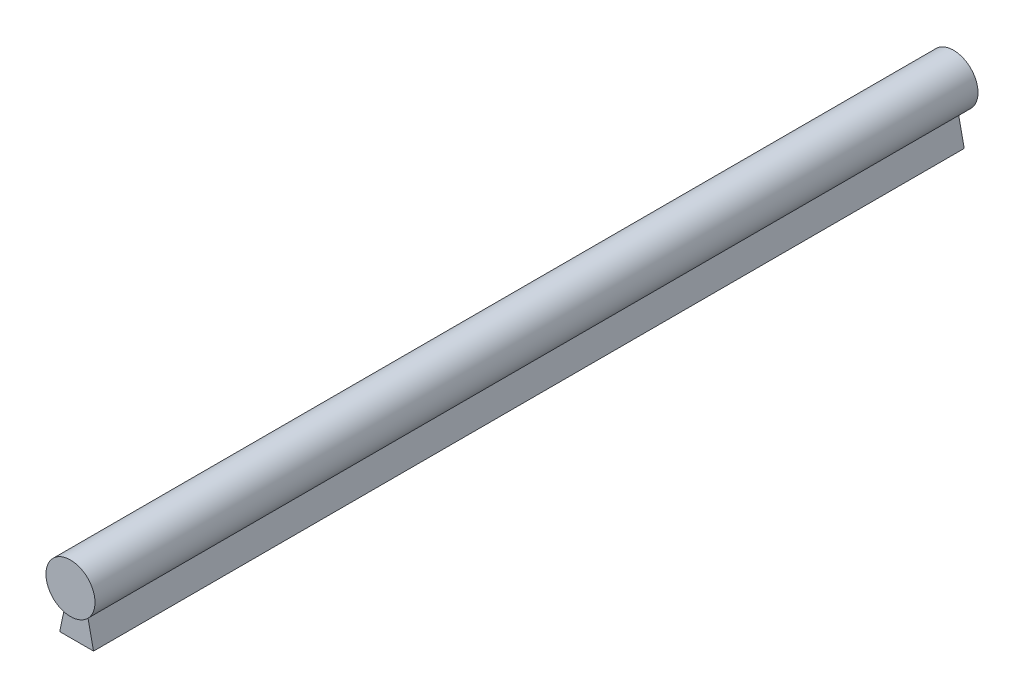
from build123d import *

# Parameters (mm, degrees)
SKETCH1_R           = 12.7
BASE_EXTRUDE_DEPTH  = 457.2
BOSS_EXTRUDE1_DEPTH = 450.85


with BuildPart() as part:
    # Sketch1 → Base-Extrude (new body)
    with BuildSketch(Plane.XY):
        Circle(SKETCH1_R)
    extrude(amount=BASE_EXTRUDE_DEPTH)

    # Sketch2 → Boss-Extrude1 (add)
    with BuildSketch(Plane.XY.offset(3.175)):
        with BuildLine():
            Line((-8.763, -25.4), (8.763, -25.4))
            Line((8.763, -25.4), (5.7689526, -11.314114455))
            ThreePointArc((5.7689526, -11.314114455), (0, -12.7), (-5.7689526, -11.314114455))
            Line((-5.7689526, -11.314114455), (-8.763, -25.4))
        make_face()
    extrude(amount=BOSS_EXTRUDE1_DEPTH)


solid = part.part
